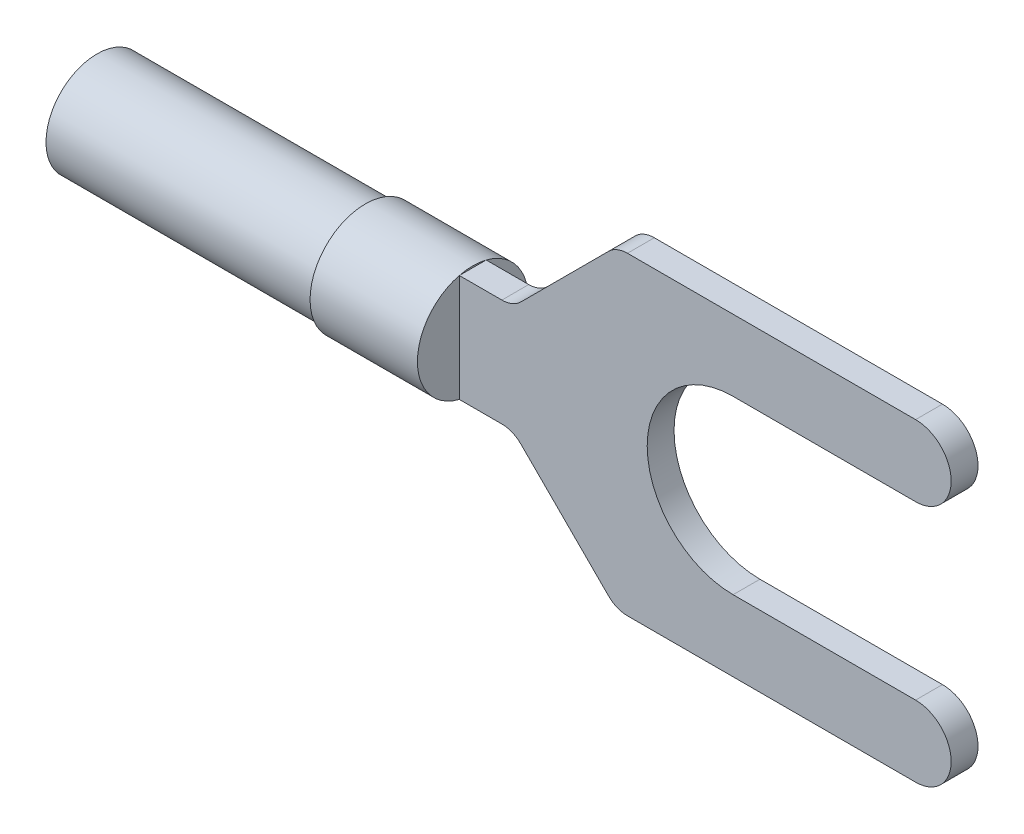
ISO-10303-21;
HEADER;
FILE_DESCRIPTION(('STEP AP214'),'2;1');
FILE_NAME('part.step','',(''),(''),'','','');
FILE_SCHEMA(('AUTOMOTIVE_DESIGN { 1 0 10303 214 1 1 1 1 }'));
ENDSEC;
DATA;
#1=APPLICATION_CONTEXT('core data for automotive mechanical design processes');
#2=APPLICATION_PROTOCOL_DEFINITION('international standard','automotive_design',2000,#1);
#3=PRODUCT_CONTEXT('',#1,'mechanical');
#4=PRODUCT('Part','Part','',(#3));
#5=PRODUCT_RELATED_PRODUCT_CATEGORY('part','',(#4));
#6=PRODUCT_DEFINITION_FORMATION('','',#4);
#7=PRODUCT_DEFINITION_CONTEXT('part definition',#1,'design');
#8=PRODUCT_DEFINITION('design','',#6,#7);
#9=PRODUCT_DEFINITION_SHAPE('','',#8);
#10=(LENGTH_UNIT() NAMED_UNIT(*) SI_UNIT(.MILLI.,.METRE.));
#11=(NAMED_UNIT(*) PLANE_ANGLE_UNIT() SI_UNIT($,.RADIAN.));
#12=(NAMED_UNIT(*) SI_UNIT($,.STERADIAN.) SOLID_ANGLE_UNIT());
#13=UNCERTAINTY_MEASURE_WITH_UNIT(LENGTH_MEASURE(1.E-05),#10,'distance_accuracy_value','');
#14=(GEOMETRIC_REPRESENTATION_CONTEXT(3) GLOBAL_UNCERTAINTY_ASSIGNED_CONTEXT((#13)) GLOBAL_UNIT_ASSIGNED_CONTEXT((#10,
#11,#12)) REPRESENTATION_CONTEXT('',''));
#15=CARTESIAN_POINT('',(0.,0.,0.));
#16=DIRECTION('',(0.,0.,1.));
#17=DIRECTION('',(1.,0.,0.));
#18=AXIS2_PLACEMENT_3D('',#15,#16,#17);
#19=CARTESIAN_POINT('',(-14.2,2.,0.5));
#20=DIRECTION('',(1.,0.,0.));
#21=DIRECTION('',(0.,0.,-1.));
#22=AXIS2_PLACEMENT_3D('',#19,#20,#21);
#23=PLANE('',#22);
#24=CARTESIAN_POINT('',(-14.2,0.,0.));
#25=DIRECTION('',(-1.,0.,0.));
#26=DIRECTION('',(0.,0.,1.));
#27=AXIS2_PLACEMENT_3D('',#24,#25,#26);
#28=CIRCLE('',#27,2.06155281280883);
#29=CARTESIAN_POINT('',(-14.2,0.,2.06155281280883));
#30=VERTEX_POINT('',#29);
#31=EDGE_CURVE('E183',#30,#30,#28,.T.);
#32=ORIENTED_EDGE('',*,*,#31,.T.);
#33=EDGE_LOOP('',(#32));
#34=FACE_BOUND('',#33,.T.);
#35=CARTESIAN_POINT('',(-14.2,0.,0.));
#36=DIRECTION('',(1.,0.,0.));
#37=DIRECTION('',(0.,0.,-1.));
#38=AXIS2_PLACEMENT_3D('',#35,#36,#37);
#39=CIRCLE('',#38,1.9);
#40=CARTESIAN_POINT('',(-14.2,0.,-1.9));
#41=VERTEX_POINT('',#40);
#42=EDGE_CURVE('E11',#41,#41,#39,.F.);
#43=ORIENTED_EDGE('',*,*,#42,.F.);
#44=EDGE_LOOP('',(#43));
#45=FACE_BOUND('',#44,.T.);
#46=ADVANCED_FACE('F31',(#34,#45),#23,.F.);
#47=CARTESIAN_POINT('',(-8.6142135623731,2.,0.5));
#48=DIRECTION('',(0.,-1.,0.));
#49=DIRECTION('',(1.,0.,0.));
#50=AXIS2_PLACEMENT_3D('',#47,#48,#49);
#51=PLANE('',#50);
#52=DIRECTION('',(0.,0.,-1.));
#53=VECTOR('',#52,1.);
#54=CARTESIAN_POINT('',(-10.2,2.,0.5));
#55=LINE('',#54,#53);
#56=CARTESIAN_POINT('',(-10.2,2.,0.5));
#57=VERTEX_POINT('',#56);
#58=CARTESIAN_POINT('',(-10.2,2.,-0.5));
#59=VERTEX_POINT('',#58);
#60=EDGE_CURVE('E54',#57,#59,#55,.T.);
#61=ORIENTED_EDGE('',*,*,#60,.F.);
#62=DIRECTION('',(-1.,0.,0.));
#63=VECTOR('',#62,1.);
#64=CARTESIAN_POINT('',(-8.6142135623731,2.,0.5));
#65=LINE('',#64,#63);
#66=CARTESIAN_POINT('',(-8.6142135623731,2.,0.5));
#67=VERTEX_POINT('',#66);
#68=EDGE_CURVE('E230',#67,#57,#65,.T.);
#69=ORIENTED_EDGE('',*,*,#68,.F.);
#70=DIRECTION('',(0.,0.,-1.));
#71=VECTOR('',#70,1.);
#72=CARTESIAN_POINT('',(-8.6142135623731,2.,0.5));
#73=LINE('',#72,#71);
#74=CARTESIAN_POINT('',(-8.6142135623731,2.,-0.5));
#75=VERTEX_POINT('',#74);
#76=EDGE_CURVE('E265',#67,#75,#73,.T.);
#77=ORIENTED_EDGE('',*,*,#76,.T.);
#78=DIRECTION('',(-1.,0.,0.));
#79=VECTOR('',#78,1.);
#80=CARTESIAN_POINT('',(-8.6142135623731,2.,-0.5));
#81=LINE('',#80,#79);
#82=EDGE_CURVE('E155',#75,#59,#81,.T.);
#83=ORIENTED_EDGE('',*,*,#82,.T.);
#84=EDGE_LOOP('',(#61,#69,#77,#83));
#85=FACE_BOUND('',#84,.T.);
#86=ADVANCED_FACE('F346',(#85),#51,.F.);
#87=CARTESIAN_POINT('',(-8.6142135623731,-2.,0.5));
#88=DIRECTION('',(0.,1.,0.));
#89=DIRECTION('',(-1.,0.,0.));
#90=AXIS2_PLACEMENT_3D('',#87,#88,#89);
#91=PLANE('',#90);
#92=DIRECTION('',(0.,0.,1.));
#93=VECTOR('',#92,1.);
#94=CARTESIAN_POINT('',(-10.2,-2.,0.5));
#95=LINE('',#94,#93);
#96=CARTESIAN_POINT('',(-10.2,-2.,-0.5));
#97=VERTEX_POINT('',#96);
#98=CARTESIAN_POINT('',(-10.2,-2.,0.5));
#99=VERTEX_POINT('',#98);
#100=EDGE_CURVE('E158',#97,#99,#95,.T.);
#101=ORIENTED_EDGE('',*,*,#100,.F.);
#102=DIRECTION('',(1.,0.,0.));
#103=VECTOR('',#102,1.);
#104=CARTESIAN_POINT('',(-8.6142135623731,-2.,-0.5));
#105=LINE('',#104,#103);
#106=CARTESIAN_POINT('',(-8.6142135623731,-2.,-0.5));
#107=VERTEX_POINT('',#106);
#108=EDGE_CURVE('E145',#97,#107,#105,.T.);
#109=ORIENTED_EDGE('',*,*,#108,.T.);
#110=DIRECTION('',(0.,0.,-1.));
#111=VECTOR('',#110,1.);
#112=CARTESIAN_POINT('',(-8.6142135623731,-2.,0.5));
#113=LINE('',#112,#111);
#114=CARTESIAN_POINT('',(-8.6142135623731,-2.,0.5));
#115=VERTEX_POINT('',#114);
#116=EDGE_CURVE('E263',#115,#107,#113,.T.);
#117=ORIENTED_EDGE('',*,*,#116,.F.);
#118=DIRECTION('',(1.,0.,0.));
#119=VECTOR('',#118,1.);
#120=CARTESIAN_POINT('',(-8.6142135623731,-2.,0.5));
#121=LINE('',#120,#119);
#122=EDGE_CURVE('E160',#99,#115,#121,.T.);
#123=ORIENTED_EDGE('',*,*,#122,.F.);
#124=EDGE_LOOP('',(#101,#109,#117,#123));
#125=FACE_BOUND('',#124,.T.);
#126=ADVANCED_FACE('F159',(#125),#91,.F.);
#127=CARTESIAN_POINT('',(0.,0.,0.5));
#128=DIRECTION('',(0.,0.,1.));
#129=DIRECTION('',(1.,0.,0.));
#130=AXIS2_PLACEMENT_3D('',#127,#128,#129);
#131=PLANE('',#130);
#132=ORIENTED_EDGE('',*,*,#68,.T.);
#133=DIRECTION('',(0.,-1.,0.));
#134=VECTOR('',#133,1.);
#135=CARTESIAN_POINT('',(-10.2,0.,0.5));
#136=LINE('',#135,#134);
#137=EDGE_CURVE('E46',#57,#99,#136,.T.);
#138=ORIENTED_EDGE('',*,*,#137,.T.);
#139=ORIENTED_EDGE('',*,*,#122,.T.);
#140=CARTESIAN_POINT('',(-8.6142135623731,-3.,0.5));
#141=DIRECTION('',(0.,0.,-1.));
#142=DIRECTION('',(-1.,0.,0.));
#143=AXIS2_PLACEMENT_3D('',#140,#141,#142);
#144=CIRCLE('',#143,1.);
#145=CARTESIAN_POINT('',(-7.90710678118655,-2.29289321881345,0.5));
#146=VERTEX_POINT('',#145);
#147=EDGE_CURVE('E233',#115,#146,#144,.T.);
#148=ORIENTED_EDGE('',*,*,#147,.T.);
#149=DIRECTION('',(0.707106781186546,-0.707106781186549,0.));
#150=VECTOR('',#149,1.);
#151=CARTESIAN_POINT('',(-4.64289321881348,-5.55710678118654,0.5));
#152=LINE('',#151,#150);
#153=CARTESIAN_POINT('',(-4.64289321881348,-5.55710678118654,0.5));
#154=VERTEX_POINT('',#153);
#155=EDGE_CURVE('E235',#146,#154,#152,.T.);
#156=ORIENTED_EDGE('',*,*,#155,.T.);
#157=CARTESIAN_POINT('',(-3.93578643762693,-4.85,0.5));
#158=DIRECTION('',(0.,0.,1.));
#159=DIRECTION('',(1.,0.,0.));
#160=AXIS2_PLACEMENT_3D('',#157,#158,#159);
#161=CIRCLE('',#160,1.);
#162=CARTESIAN_POINT('',(-3.93578643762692,-5.85,0.5));
#163=VERTEX_POINT('',#162);
#164=EDGE_CURVE('E237',#154,#163,#161,.T.);
#165=ORIENTED_EDGE('',*,*,#164,.T.);
#166=DIRECTION('',(1.,0.,0.));
#167=VECTOR('',#166,1.);
#168=CARTESIAN_POINT('',(6.8,-5.85,0.5));
#169=LINE('',#168,#167);
#170=CARTESIAN_POINT('',(6.8,-5.85,0.5));
#171=VERTEX_POINT('',#170);
#172=EDGE_CURVE('E239',#163,#171,#169,.T.);
#173=ORIENTED_EDGE('',*,*,#172,.T.);
#174=CARTESIAN_POINT('',(6.8,-4.525,0.5));
#175=DIRECTION('',(0.,0.,1.));
#176=DIRECTION('',(-1.,0.,0.));
#177=AXIS2_PLACEMENT_3D('',#174,#175,#176);
#178=CIRCLE('',#177,1.325);
#179=CARTESIAN_POINT('',(6.8,-3.2,0.5));
#180=VERTEX_POINT('',#179);
#181=EDGE_CURVE('E241',#171,#180,#178,.T.);
#182=ORIENTED_EDGE('',*,*,#181,.T.);
#183=DIRECTION('',(-1.,0.,0.));
#184=VECTOR('',#183,1.);
#185=CARTESIAN_POINT('',(0.,-3.2,0.5));
#186=LINE('',#185,#184);
#187=CARTESIAN_POINT('',(0.,-3.2,0.5));
#188=VERTEX_POINT('',#187);
#189=EDGE_CURVE('E243',#180,#188,#186,.T.);
#190=ORIENTED_EDGE('',*,*,#189,.T.);
#191=CARTESIAN_POINT('',(0.,0.,0.5));
#192=DIRECTION('',(0.,0.,-1.));
#193=DIRECTION('',(1.,0.,0.));
#194=AXIS2_PLACEMENT_3D('',#191,#192,#193);
#195=CIRCLE('',#194,3.2);
#196=CARTESIAN_POINT('',(0.,3.2,0.5));
#197=VERTEX_POINT('',#196);
#198=EDGE_CURVE('E215',#188,#197,#195,.T.);
#199=ORIENTED_EDGE('',*,*,#198,.T.);
#200=DIRECTION('',(1.,0.,0.));
#201=VECTOR('',#200,1.);
#202=CARTESIAN_POINT('',(0.,3.2,0.5));
#203=LINE('',#202,#201);
#204=CARTESIAN_POINT('',(6.8,3.2,0.5));
#205=VERTEX_POINT('',#204);
#206=EDGE_CURVE('E218',#197,#205,#203,.T.);
#207=ORIENTED_EDGE('',*,*,#206,.T.);
#208=CARTESIAN_POINT('',(6.8,4.525,0.5));
#209=DIRECTION('',(0.,0.,1.));
#210=DIRECTION('',(1.,0.,0.));
#211=AXIS2_PLACEMENT_3D('',#208,#209,#210);
#212=CIRCLE('',#211,1.325);
#213=CARTESIAN_POINT('',(6.8,5.85,0.5));
#214=VERTEX_POINT('',#213);
#215=EDGE_CURVE('E220',#205,#214,#212,.T.);
#216=ORIENTED_EDGE('',*,*,#215,.T.);
#217=DIRECTION('',(-1.,0.,0.));
#218=VECTOR('',#217,1.);
#219=CARTESIAN_POINT('',(6.8,5.85,0.5));
#220=LINE('',#219,#218);
#221=CARTESIAN_POINT('',(-3.93578643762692,5.85,0.5));
#222=VERTEX_POINT('',#221);
#223=EDGE_CURVE('E222',#214,#222,#220,.T.);
#224=ORIENTED_EDGE('',*,*,#223,.T.);
#225=CARTESIAN_POINT('',(-3.93578643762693,4.85,0.5));
#226=DIRECTION('',(0.,0.,1.));
#227=DIRECTION('',(1.,0.,0.));
#228=AXIS2_PLACEMENT_3D('',#225,#226,#227);
#229=CIRCLE('',#228,1.);
#230=CARTESIAN_POINT('',(-4.64289321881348,5.55710678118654,0.5));
#231=VERTEX_POINT('',#230);
#232=EDGE_CURVE('E224',#222,#231,#229,.T.);
#233=ORIENTED_EDGE('',*,*,#232,.T.);
#234=DIRECTION('',(-0.707106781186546,-0.707106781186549,0.));
#235=VECTOR('',#234,1.);
#236=CARTESIAN_POINT('',(-4.64289321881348,5.55710678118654,0.5));
#237=LINE('',#236,#235);
#238=CARTESIAN_POINT('',(-7.90710678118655,2.29289321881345,0.5));
#239=VERTEX_POINT('',#238);
#240=EDGE_CURVE('E226',#231,#239,#237,.T.);
#241=ORIENTED_EDGE('',*,*,#240,.T.);
#242=CARTESIAN_POINT('',(-8.6142135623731,3.,0.5));
#243=DIRECTION('',(0.,0.,-1.));
#244=DIRECTION('',(-1.,0.,0.));
#245=AXIS2_PLACEMENT_3D('',#242,#243,#244);
#246=CIRCLE('',#245,1.);
#247=EDGE_CURVE('E228',#239,#67,#246,.T.);
#248=ORIENTED_EDGE('',*,*,#247,.T.);
#249=EDGE_LOOP('',(#132,#138,#139,#148,#156,#165,#173,#182,#190,#199,#207,#216,#224,#233,#241,#248));
#250=FACE_BOUND('',#249,.T.);
#251=ADVANCED_FACE('F306',(#250),#131,.T.);
#252=CARTESIAN_POINT('',(0.,0.,-0.5));
#253=DIRECTION('',(0.,0.,1.));
#254=DIRECTION('',(1.,0.,0.));
#255=AXIS2_PLACEMENT_3D('',#252,#253,#254);
#256=PLANE('',#255);
#257=DIRECTION('',(0.,-1.,0.));
#258=VECTOR('',#257,1.);
#259=CARTESIAN_POINT('',(-10.2,0.,-0.5));
#260=LINE('',#259,#258);
#261=EDGE_CURVE('E39',#59,#97,#260,.T.);
#262=ORIENTED_EDGE('',*,*,#261,.F.);
#263=ORIENTED_EDGE('',*,*,#82,.F.);
#264=CARTESIAN_POINT('',(-8.6142135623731,3.,-0.5));
#265=DIRECTION('',(0.,0.,-1.));
#266=DIRECTION('',(-1.,0.,0.));
#267=AXIS2_PLACEMENT_3D('',#264,#265,#266);
#268=CIRCLE('',#267,1.);
#269=CARTESIAN_POINT('',(-7.90710678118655,2.29289321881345,-0.5));
#270=VERTEX_POINT('',#269);
#271=EDGE_CURVE('E201',#270,#75,#268,.T.);
#272=ORIENTED_EDGE('',*,*,#271,.F.);
#273=DIRECTION('',(-0.707106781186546,-0.707106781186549,0.));
#274=VECTOR('',#273,1.);
#275=CARTESIAN_POINT('',(-4.64289321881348,5.55710678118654,-0.5));
#276=LINE('',#275,#274);
#277=CARTESIAN_POINT('',(-4.64289321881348,5.55710678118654,-0.5));
#278=VERTEX_POINT('',#277);
#279=EDGE_CURVE('E199',#278,#270,#276,.T.);
#280=ORIENTED_EDGE('',*,*,#279,.F.);
#281=CARTESIAN_POINT('',(-3.93578643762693,4.85,-0.5));
#282=DIRECTION('',(0.,0.,1.));
#283=DIRECTION('',(1.,0.,0.));
#284=AXIS2_PLACEMENT_3D('',#281,#282,#283);
#285=CIRCLE('',#284,1.);
#286=CARTESIAN_POINT('',(-3.93578643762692,5.85,-0.5));
#287=VERTEX_POINT('',#286);
#288=EDGE_CURVE('E197',#287,#278,#285,.T.);
#289=ORIENTED_EDGE('',*,*,#288,.F.);
#290=DIRECTION('',(-1.,0.,0.));
#291=VECTOR('',#290,1.);
#292=CARTESIAN_POINT('',(6.8,5.85,-0.5));
#293=LINE('',#292,#291);
#294=CARTESIAN_POINT('',(6.8,5.85,-0.5));
#295=VERTEX_POINT('',#294);
#296=EDGE_CURVE('E195',#295,#287,#293,.T.);
#297=ORIENTED_EDGE('',*,*,#296,.F.);
#298=CARTESIAN_POINT('',(6.8,4.525,-0.5));
#299=DIRECTION('',(0.,0.,1.));
#300=DIRECTION('',(1.,0.,0.));
#301=AXIS2_PLACEMENT_3D('',#298,#299,#300);
#302=CIRCLE('',#301,1.325);
#303=CARTESIAN_POINT('',(6.8,3.2,-0.5));
#304=VERTEX_POINT('',#303);
#305=EDGE_CURVE('E193',#304,#295,#302,.T.);
#306=ORIENTED_EDGE('',*,*,#305,.F.);
#307=DIRECTION('',(1.,0.,0.));
#308=VECTOR('',#307,1.);
#309=CARTESIAN_POINT('',(0.,3.2,-0.5));
#310=LINE('',#309,#308);
#311=CARTESIAN_POINT('',(0.,3.2,-0.5));
#312=VERTEX_POINT('',#311);
#313=EDGE_CURVE('E191',#312,#304,#310,.T.);
#314=ORIENTED_EDGE('',*,*,#313,.F.);
#315=CARTESIAN_POINT('',(0.,0.,-0.5));
#316=DIRECTION('',(0.,0.,-1.));
#317=DIRECTION('',(1.,0.,0.));
#318=AXIS2_PLACEMENT_3D('',#315,#316,#317);
#319=CIRCLE('',#318,3.2);
#320=CARTESIAN_POINT('',(0.,-3.2,-0.5));
#321=VERTEX_POINT('',#320);
#322=EDGE_CURVE('E188',#321,#312,#319,.T.);
#323=ORIENTED_EDGE('',*,*,#322,.F.);
#324=DIRECTION('',(-1.,0.,0.));
#325=VECTOR('',#324,1.);
#326=CARTESIAN_POINT('',(0.,-3.2,-0.5));
#327=LINE('',#326,#325);
#328=CARTESIAN_POINT('',(6.8,-3.2,-0.5));
#329=VERTEX_POINT('',#328);
#330=EDGE_CURVE('E213',#329,#321,#327,.T.);
#331=ORIENTED_EDGE('',*,*,#330,.F.);
#332=CARTESIAN_POINT('',(6.8,-4.525,-0.5));
#333=DIRECTION('',(0.,0.,1.));
#334=DIRECTION('',(-1.,0.,0.));
#335=AXIS2_PLACEMENT_3D('',#332,#333,#334);
#336=CIRCLE('',#335,1.325);
#337=CARTESIAN_POINT('',(6.8,-5.85,-0.5));
#338=VERTEX_POINT('',#337);
#339=EDGE_CURVE('E211',#338,#329,#336,.T.);
#340=ORIENTED_EDGE('',*,*,#339,.F.);
#341=DIRECTION('',(1.,0.,0.));
#342=VECTOR('',#341,1.);
#343=CARTESIAN_POINT('',(6.8,-5.85,-0.5));
#344=LINE('',#343,#342);
#345=CARTESIAN_POINT('',(-3.93578643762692,-5.85,-0.5));
#346=VERTEX_POINT('',#345);
#347=EDGE_CURVE('E209',#346,#338,#344,.T.);
#348=ORIENTED_EDGE('',*,*,#347,.F.);
#349=CARTESIAN_POINT('',(-3.93578643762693,-4.85,-0.5));
#350=DIRECTION('',(0.,0.,1.));
#351=DIRECTION('',(1.,0.,0.));
#352=AXIS2_PLACEMENT_3D('',#349,#350,#351);
#353=CIRCLE('',#352,1.);
#354=CARTESIAN_POINT('',(-4.64289321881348,-5.55710678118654,-0.5));
#355=VERTEX_POINT('',#354);
#356=EDGE_CURVE('E207',#355,#346,#353,.T.);
#357=ORIENTED_EDGE('',*,*,#356,.F.);
#358=DIRECTION('',(0.707106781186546,-0.707106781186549,0.));
#359=VECTOR('',#358,1.);
#360=CARTESIAN_POINT('',(-4.64289321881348,-5.55710678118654,-0.5));
#361=LINE('',#360,#359);
#362=CARTESIAN_POINT('',(-7.90710678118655,-2.29289321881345,-0.5));
#363=VERTEX_POINT('',#362);
#364=EDGE_CURVE('E205',#363,#355,#361,.T.);
#365=ORIENTED_EDGE('',*,*,#364,.F.);
#366=CARTESIAN_POINT('',(-8.6142135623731,-3.,-0.5));
#367=DIRECTION('',(0.,0.,-1.));
#368=DIRECTION('',(-1.,0.,0.));
#369=AXIS2_PLACEMENT_3D('',#366,#367,#368);
#370=CIRCLE('',#369,1.);
#371=EDGE_CURVE('E151',#107,#363,#370,.T.);
#372=ORIENTED_EDGE('',*,*,#371,.F.);
#373=ORIENTED_EDGE('',*,*,#108,.F.);
#374=EDGE_LOOP('',(#262,#263,#272,#280,#289,#297,#306,#314,#323,#331,#340,#348,#357,#365,#372,#373));
#375=FACE_BOUND('',#374,.T.);
#376=ADVANCED_FACE('F147',(#375),#256,.F.);
#377=CARTESIAN_POINT('',(0.,0.,0.5));
#378=DIRECTION('',(0.,0.,-1.));
#379=DIRECTION('',(-1.,0.,0.));
#380=AXIS2_PLACEMENT_3D('',#377,#378,#379);
#381=CYLINDRICAL_SURFACE('',#380,3.2);
#382=ORIENTED_EDGE('',*,*,#322,.T.);
#383=DIRECTION('',(0.,0.,-1.));
#384=VECTOR('',#383,1.);
#385=CARTESIAN_POINT('',(0.,3.2,0.5));
#386=LINE('',#385,#384);
#387=EDGE_CURVE('E172',#197,#312,#386,.T.);
#388=ORIENTED_EDGE('',*,*,#387,.F.);
#389=ORIENTED_EDGE('',*,*,#198,.F.);
#390=DIRECTION('',(0.,0.,-1.));
#391=VECTOR('',#390,1.);
#392=CARTESIAN_POINT('',(0.,-3.2,0.5));
#393=LINE('',#392,#391);
#394=EDGE_CURVE('E245',#188,#321,#393,.T.);
#395=ORIENTED_EDGE('',*,*,#394,.T.);
#396=EDGE_LOOP('',(#382,#388,#389,#395));
#397=FACE_BOUND('',#396,.T.);
#398=ADVANCED_FACE('F33',(#397),#381,.F.);
#399=CARTESIAN_POINT('',(0.,3.2,0.5));
#400=DIRECTION('',(0.,1.,0.));
#401=DIRECTION('',(0.,0.,1.));
#402=AXIS2_PLACEMENT_3D('',#399,#400,#401);
#403=PLANE('',#402);
#404=ORIENTED_EDGE('',*,*,#313,.T.);
#405=DIRECTION('',(0.,0.,-1.));
#406=VECTOR('',#405,1.);
#407=CARTESIAN_POINT('',(6.8,3.2,0.5));
#408=LINE('',#407,#406);
#409=EDGE_CURVE('E280',#205,#304,#408,.T.);
#410=ORIENTED_EDGE('',*,*,#409,.F.);
#411=ORIENTED_EDGE('',*,*,#206,.F.);
#412=ORIENTED_EDGE('',*,*,#387,.T.);
#413=EDGE_LOOP('',(#404,#410,#411,#412));
#414=FACE_BOUND('',#413,.T.);
#415=ADVANCED_FACE('F286',(#414),#403,.F.);
#416=CARTESIAN_POINT('',(6.8,4.525,0.5));
#417=DIRECTION('',(0.,0.,-1.));
#418=DIRECTION('',(-1.,0.,0.));
#419=AXIS2_PLACEMENT_3D('',#416,#417,#418);
#420=CYLINDRICAL_SURFACE('',#419,1.325);
#421=ORIENTED_EDGE('',*,*,#305,.T.);
#422=DIRECTION('',(0.,0.,-1.));
#423=VECTOR('',#422,1.);
#424=CARTESIAN_POINT('',(6.8,5.85,0.5));
#425=LINE('',#424,#423);
#426=EDGE_CURVE('E277',#214,#295,#425,.T.);
#427=ORIENTED_EDGE('',*,*,#426,.F.);
#428=ORIENTED_EDGE('',*,*,#215,.F.);
#429=ORIENTED_EDGE('',*,*,#409,.T.);
#430=EDGE_LOOP('',(#421,#427,#428,#429));
#431=FACE_BOUND('',#430,.T.);
#432=ADVANCED_FACE('F299',(#431),#420,.T.);
#433=CARTESIAN_POINT('',(6.8,5.85,0.5));
#434=DIRECTION('',(0.,-1.,0.));
#435=DIRECTION('',(1.,0.,0.));
#436=AXIS2_PLACEMENT_3D('',#433,#434,#435);
#437=PLANE('',#436);
#438=ORIENTED_EDGE('',*,*,#296,.T.);
#439=DIRECTION('',(0.,0.,-1.));
#440=VECTOR('',#439,1.);
#441=CARTESIAN_POINT('',(-3.93578643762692,5.85,0.5));
#442=LINE('',#441,#440);
#443=EDGE_CURVE('E274',#222,#287,#442,.T.);
#444=ORIENTED_EDGE('',*,*,#443,.F.);
#445=ORIENTED_EDGE('',*,*,#223,.F.);
#446=ORIENTED_EDGE('',*,*,#426,.T.);
#447=EDGE_LOOP('',(#438,#444,#445,#446));
#448=FACE_BOUND('',#447,.T.);
#449=ADVANCED_FACE('F303',(#448),#437,.F.);
#450=CARTESIAN_POINT('',(-3.93578643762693,4.85,0.5));
#451=DIRECTION('',(0.,0.,-1.));
#452=DIRECTION('',(-1.,0.,0.));
#453=AXIS2_PLACEMENT_3D('',#450,#451,#452);
#454=CYLINDRICAL_SURFACE('',#453,1.);
#455=ORIENTED_EDGE('',*,*,#288,.T.);
#456=DIRECTION('',(0.,0.,-1.));
#457=VECTOR('',#456,1.);
#458=CARTESIAN_POINT('',(-4.64289321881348,5.55710678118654,0.5));
#459=LINE('',#458,#457);
#460=EDGE_CURVE('E271',#231,#278,#459,.T.);
#461=ORIENTED_EDGE('',*,*,#460,.F.);
#462=ORIENTED_EDGE('',*,*,#232,.F.);
#463=ORIENTED_EDGE('',*,*,#443,.T.);
#464=EDGE_LOOP('',(#455,#461,#462,#463));
#465=FACE_BOUND('',#464,.T.);
#466=ADVANCED_FACE('F358',(#465),#454,.T.);
#467=CARTESIAN_POINT('',(-4.64289321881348,5.55710678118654,0.5));
#468=DIRECTION('',(0.707106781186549,-0.707106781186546,0.));
#469=DIRECTION('',(0.707106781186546,0.707106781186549,0.));
#470=AXIS2_PLACEMENT_3D('',#467,#468,#469);
#471=PLANE('',#470);
#472=ORIENTED_EDGE('',*,*,#279,.T.);
#473=DIRECTION('',(0.,0.,-1.));
#474=VECTOR('',#473,1.);
#475=CARTESIAN_POINT('',(-7.90710678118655,2.29289321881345,0.5));
#476=LINE('',#475,#474);
#477=EDGE_CURVE('E268',#239,#270,#476,.T.);
#478=ORIENTED_EDGE('',*,*,#477,.F.);
#479=ORIENTED_EDGE('',*,*,#240,.F.);
#480=ORIENTED_EDGE('',*,*,#460,.T.);
#481=EDGE_LOOP('',(#472,#478,#479,#480));
#482=FACE_BOUND('',#481,.T.);
#483=ADVANCED_FACE('F341',(#482),#471,.F.);
#484=CARTESIAN_POINT('',(-8.6142135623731,3.,0.5));
#485=DIRECTION('',(0.,0.,-1.));
#486=DIRECTION('',(-1.,0.,0.));
#487=AXIS2_PLACEMENT_3D('',#484,#485,#486);
#488=CYLINDRICAL_SURFACE('',#487,1.);
#489=ORIENTED_EDGE('',*,*,#271,.T.);
#490=ORIENTED_EDGE('',*,*,#76,.F.);
#491=ORIENTED_EDGE('',*,*,#247,.F.);
#492=ORIENTED_EDGE('',*,*,#477,.T.);
#493=EDGE_LOOP('',(#489,#490,#491,#492));
#494=FACE_BOUND('',#493,.T.);
#495=ADVANCED_FACE('F334',(#494),#488,.F.);
#496=CARTESIAN_POINT('',(-8.6142135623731,-3.,0.5));
#497=DIRECTION('',(0.,0.,-1.));
#498=DIRECTION('',(-1.,0.,0.));
#499=AXIS2_PLACEMENT_3D('',#496,#497,#498);
#500=CYLINDRICAL_SURFACE('',#499,1.);
#501=ORIENTED_EDGE('',*,*,#371,.T.);
#502=DIRECTION('',(0.,0.,-1.));
#503=VECTOR('',#502,1.);
#504=CARTESIAN_POINT('',(-7.90710678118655,-2.29289321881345,0.5));
#505=LINE('',#504,#503);
#506=EDGE_CURVE('E260',#146,#363,#505,.T.);
#507=ORIENTED_EDGE('',*,*,#506,.F.);
#508=ORIENTED_EDGE('',*,*,#147,.F.);
#509=ORIENTED_EDGE('',*,*,#116,.T.);
#510=EDGE_LOOP('',(#501,#507,#508,#509));
#511=FACE_BOUND('',#510,.T.);
#512=ADVANCED_FACE('F332',(#511),#500,.F.);
#513=CARTESIAN_POINT('',(-4.64289321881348,-5.55710678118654,0.5));
#514=DIRECTION('',(0.707106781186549,0.707106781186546,0.));
#515=DIRECTION('',(-0.707106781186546,0.707106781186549,0.));
#516=AXIS2_PLACEMENT_3D('',#513,#514,#515);
#517=PLANE('',#516);
#518=ORIENTED_EDGE('',*,*,#364,.T.);
#519=DIRECTION('',(0.,0.,-1.));
#520=VECTOR('',#519,1.);
#521=CARTESIAN_POINT('',(-4.64289321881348,-5.55710678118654,0.5));
#522=LINE('',#521,#520);
#523=EDGE_CURVE('E257',#154,#355,#522,.T.);
#524=ORIENTED_EDGE('',*,*,#523,.F.);
#525=ORIENTED_EDGE('',*,*,#155,.F.);
#526=ORIENTED_EDGE('',*,*,#506,.T.);
#527=EDGE_LOOP('',(#518,#524,#525,#526));
#528=FACE_BOUND('',#527,.T.);
#529=ADVANCED_FACE('F328',(#528),#517,.F.);
#530=CARTESIAN_POINT('',(-3.93578643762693,-4.85,0.5));
#531=DIRECTION('',(0.,0.,-1.));
#532=DIRECTION('',(-1.,0.,0.));
#533=AXIS2_PLACEMENT_3D('',#530,#531,#532);
#534=CYLINDRICAL_SURFACE('',#533,1.);
#535=ORIENTED_EDGE('',*,*,#356,.T.);
#536=DIRECTION('',(0.,0.,-1.));
#537=VECTOR('',#536,1.);
#538=CARTESIAN_POINT('',(-3.93578643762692,-5.85,0.5));
#539=LINE('',#538,#537);
#540=EDGE_CURVE('E254',#163,#346,#539,.T.);
#541=ORIENTED_EDGE('',*,*,#540,.F.);
#542=ORIENTED_EDGE('',*,*,#164,.F.);
#543=ORIENTED_EDGE('',*,*,#523,.T.);
#544=EDGE_LOOP('',(#535,#541,#542,#543));
#545=FACE_BOUND('',#544,.T.);
#546=ADVANCED_FACE('F324',(#545),#534,.T.);
#547=CARTESIAN_POINT('',(6.8,-5.85,0.5));
#548=DIRECTION('',(0.,1.,0.));
#549=DIRECTION('',(-1.,0.,0.));
#550=AXIS2_PLACEMENT_3D('',#547,#548,#549);
#551=PLANE('',#550);
#552=ORIENTED_EDGE('',*,*,#347,.T.);
#553=DIRECTION('',(0.,0.,-1.));
#554=VECTOR('',#553,1.);
#555=CARTESIAN_POINT('',(6.8,-5.85,0.5));
#556=LINE('',#555,#554);
#557=EDGE_CURVE('E251',#171,#338,#556,.T.);
#558=ORIENTED_EDGE('',*,*,#557,.F.);
#559=ORIENTED_EDGE('',*,*,#172,.F.);
#560=ORIENTED_EDGE('',*,*,#540,.T.);
#561=EDGE_LOOP('',(#552,#558,#559,#560));
#562=FACE_BOUND('',#561,.T.);
#563=ADVANCED_FACE('F319',(#562),#551,.F.);
#564=CARTESIAN_POINT('',(6.8,-4.525,0.5));
#565=DIRECTION('',(0.,0.,-1.));
#566=DIRECTION('',(-1.,0.,0.));
#567=AXIS2_PLACEMENT_3D('',#564,#565,#566);
#568=CYLINDRICAL_SURFACE('',#567,1.325);
#569=ORIENTED_EDGE('',*,*,#339,.T.);
#570=DIRECTION('',(0.,0.,-1.));
#571=VECTOR('',#570,1.);
#572=CARTESIAN_POINT('',(6.8,-3.2,0.5));
#573=LINE('',#572,#571);
#574=EDGE_CURVE('E248',#180,#329,#573,.T.);
#575=ORIENTED_EDGE('',*,*,#574,.F.);
#576=ORIENTED_EDGE('',*,*,#181,.F.);
#577=ORIENTED_EDGE('',*,*,#557,.T.);
#578=EDGE_LOOP('',(#569,#575,#576,#577));
#579=FACE_BOUND('',#578,.T.);
#580=ADVANCED_FACE('F314',(#579),#568,.T.);
#581=CARTESIAN_POINT('',(0.,-3.2,0.5));
#582=DIRECTION('',(0.,-1.,0.));
#583=DIRECTION('',(0.,0.,-1.));
#584=AXIS2_PLACEMENT_3D('',#581,#582,#583);
#585=PLANE('',#584);
#586=ORIENTED_EDGE('',*,*,#330,.T.);
#587=ORIENTED_EDGE('',*,*,#394,.F.);
#588=ORIENTED_EDGE('',*,*,#189,.F.);
#589=ORIENTED_EDGE('',*,*,#574,.T.);
#590=EDGE_LOOP('',(#586,#587,#588,#589));
#591=FACE_BOUND('',#590,.T.);
#592=ADVANCED_FACE('F312',(#591),#585,.F.);
#593=CARTESIAN_POINT('',(-10.2,0.,0.));
#594=DIRECTION('',(-1.,0.,0.));
#595=DIRECTION('',(0.,0.,1.));
#596=AXIS2_PLACEMENT_3D('',#593,#594,#595);
#597=CYLINDRICAL_SURFACE('',#596,2.06155281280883);
#598=ORIENTED_EDGE('',*,*,#31,.F.);
#599=EDGE_LOOP('',(#598));
#600=FACE_BOUND('',#599,.T.);
#601=CARTESIAN_POINT('',(-10.2,0.,0.));
#602=DIRECTION('',(-1.,0.,0.));
#603=DIRECTION('',(0.,0.,1.));
#604=AXIS2_PLACEMENT_3D('',#601,#602,#603);
#605=CIRCLE('',#604,2.06155281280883);
#606=EDGE_CURVE('E178',#99,#57,#605,.T.);
#607=ORIENTED_EDGE('',*,*,#606,.T.);
#608=EDGE_CURVE('E164',#57,#59,#605,.T.);
#609=ORIENTED_EDGE('',*,*,#608,.T.);
#610=EDGE_CURVE('E170',#59,#97,#605,.T.);
#611=ORIENTED_EDGE('',*,*,#610,.T.);
#612=EDGE_CURVE('E174',#97,#99,#605,.T.);
#613=ORIENTED_EDGE('',*,*,#612,.T.);
#614=EDGE_LOOP('',(#607,#609,#611,#613));
#615=FACE_BOUND('',#614,.T.);
#616=ADVANCED_FACE('F180',(#600,#615),#597,.T.);
#617=CARTESIAN_POINT('',(-10.2,0.,0.));
#618=DIRECTION('',(-1.,0.,0.));
#619=DIRECTION('',(0.,0.,1.));
#620=AXIS2_PLACEMENT_3D('',#617,#618,#619);
#621=PLANE('',#620);
#622=ORIENTED_EDGE('',*,*,#608,.F.);
#623=ORIENTED_EDGE('',*,*,#60,.T.);
#624=EDGE_LOOP('',(#622,#623));
#625=FACE_BOUND('',#624,.T.);
#626=ADVANCED_FACE('F411',(#625),#621,.F.);
#627=ORIENTED_EDGE('',*,*,#612,.F.);
#628=ORIENTED_EDGE('',*,*,#100,.T.);
#629=EDGE_LOOP('',(#627,#628));
#630=FACE_BOUND('',#629,.T.);
#631=ADVANCED_FACE('F175',(#630),#621,.F.);
#632=ORIENTED_EDGE('',*,*,#610,.F.);
#633=ORIENTED_EDGE('',*,*,#261,.T.);
#634=EDGE_LOOP('',(#632,#633));
#635=FACE_BOUND('',#634,.T.);
#636=ADVANCED_FACE('F168',(#635),#621,.F.);
#637=ORIENTED_EDGE('',*,*,#137,.F.);
#638=ORIENTED_EDGE('',*,*,#606,.F.);
#639=EDGE_LOOP('',(#637,#638));
#640=FACE_BOUND('',#639,.T.);
#641=ADVANCED_FACE('F419',(#640),#621,.F.);
#642=CARTESIAN_POINT('',(-24.2,0.,0.));
#643=DIRECTION('',(1.,0.,0.));
#644=DIRECTION('',(0.,0.,-1.));
#645=AXIS2_PLACEMENT_3D('',#642,#643,#644);
#646=CYLINDRICAL_SURFACE('',#645,1.9);
#647=CARTESIAN_POINT('',(-24.2,0.,0.));
#648=DIRECTION('',(-1.,0.,0.));
#649=DIRECTION('',(0.,0.,1.));
#650=AXIS2_PLACEMENT_3D('',#647,#648,#649);
#651=CIRCLE('',#650,1.9);
#652=CARTESIAN_POINT('',(-24.2,0.,1.9));
#653=VERTEX_POINT('',#652);
#654=EDGE_CURVE('E552',#653,#653,#651,.T.);
#655=ORIENTED_EDGE('',*,*,#654,.F.);
#656=EDGE_LOOP('',(#655));
#657=FACE_BOUND('',#656,.T.);
#658=ORIENTED_EDGE('',*,*,#42,.T.);
#659=EDGE_LOOP('',(#658));
#660=FACE_BOUND('',#659,.T.);
#661=ADVANCED_FACE('F435',(#657,#660),#646,.T.);
#662=CARTESIAN_POINT('',(-24.2,0.,0.));
#663=DIRECTION('',(-1.,0.,0.));
#664=DIRECTION('',(0.,0.,1.));
#665=AXIS2_PLACEMENT_3D('',#662,#663,#664);
#666=PLANE('',#665);
#667=ORIENTED_EDGE('',*,*,#654,.T.);
#668=EDGE_LOOP('',(#667));
#669=FACE_BOUND('',#668,.T.);
#670=ADVANCED_FACE('F442',(#669),#666,.T.);
#671=CLOSED_SHELL('',(#46,#86,#126,#251,#376,#398,#415,#432,#449,#466,#483,#495,#512,#529,#546,
#563,#580,#592,#616,#626,#631,#636,#641,#661,#670));
#672=MANIFOLD_SOLID_BREP('B2',#671);
#673=ADVANCED_BREP_SHAPE_REPRESENTATION('',(#18,#672),#14);
#674=SHAPE_DEFINITION_REPRESENTATION(#9,#673);
ENDSEC;
END-ISO-10303-21;
